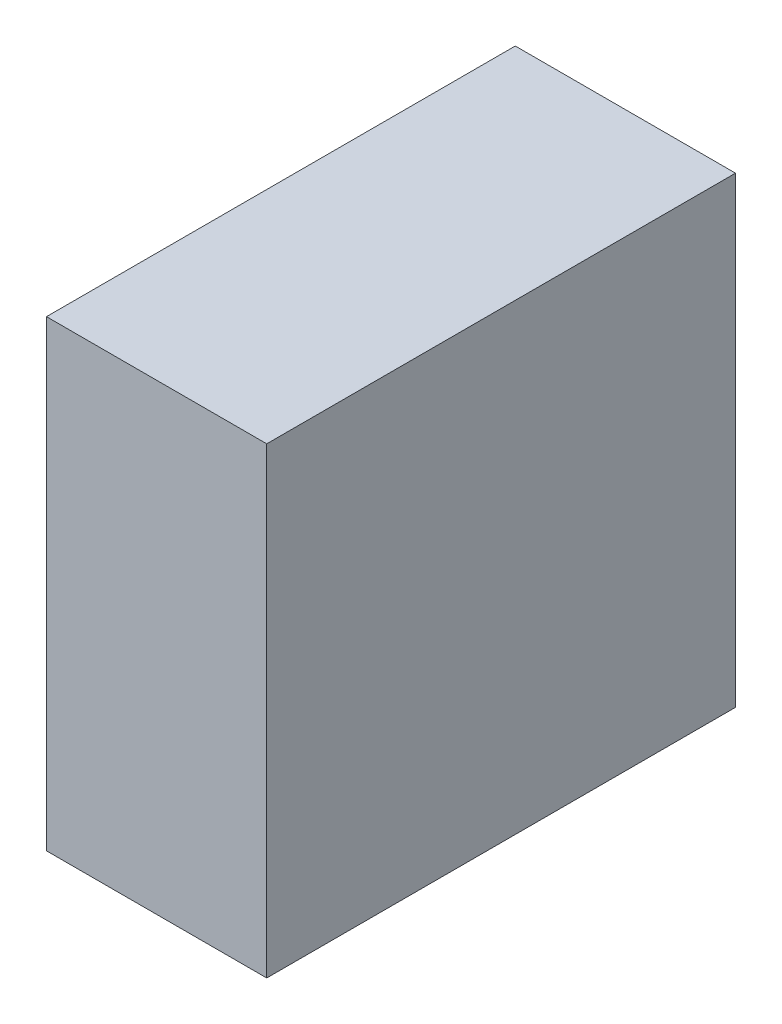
from build123d import *

# Parameters (mm, degrees)
SKETCH1_W           = 35.8
SKETCH1_H           = 76.2
BOSS_EXTRUDE1_DEPTH = 75.2


with BuildPart() as part:
    # Sketch1 → Boss-Extrude1 (new body)
    with BuildSketch(Plane(origin=(0, 0, 0), x_dir=(1, 0, 0), z_dir=(0, 1, 0))):
        with Locations((17.9, 38.1)):
            Rectangle(SKETCH1_W, SKETCH1_H)
    extrude(amount=BOSS_EXTRUDE1_DEPTH)


solid = part.part
